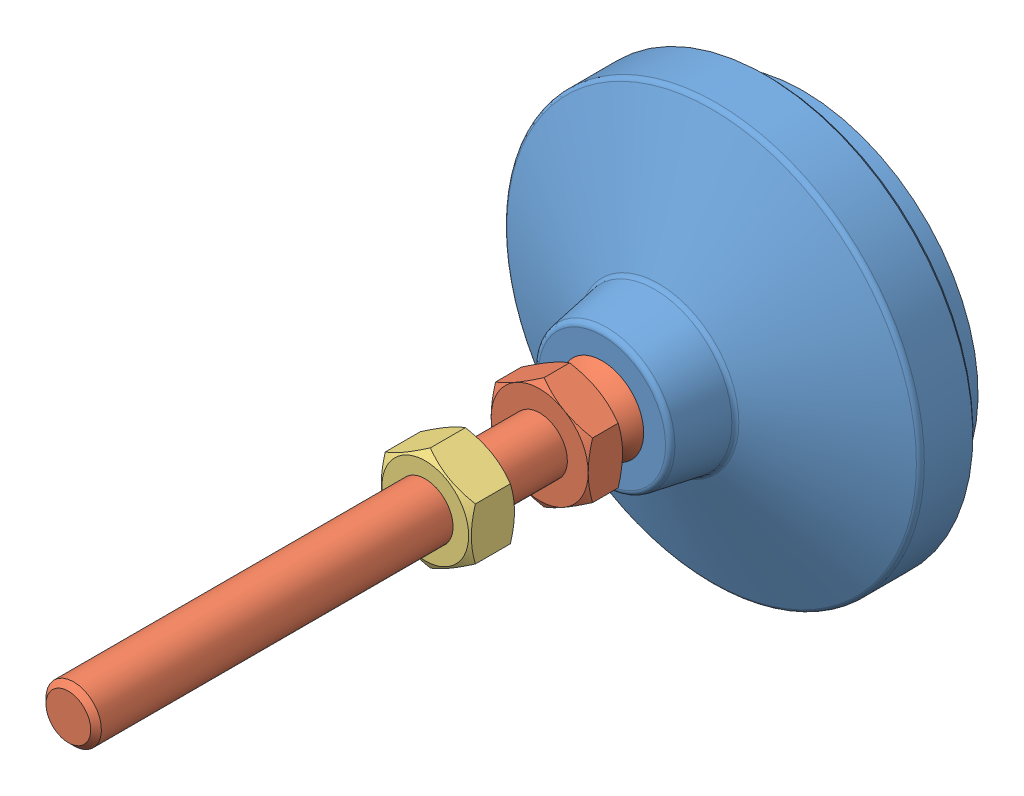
SolidWorks assembly LSVA50-M8X68-SUS.sldasm, configuration Default (file format 15000). Lengths in mm.
Overall size (60 60 106).
3 component instances, 3 part files, 0 mates.
Components (placement in the parent):
- LSVA50-M8X68-SUS_01-1: LSVA50-M8X68-SUS_01.sldprt [Default] at (0 0 5) x (1 0 0) z (0 -1 0) size (60 29 60)
- LSVA50-M8X68-SUS_02-1: LSVA50-M8X68-SUS_02.sldprt [Default] at (0 0 25.4) x (1 0 0) z (0 -1 0) size (14 87.6 16.17)
- LSVA50-M8X68-SUS_03-1: LSVA50-M8X68-SUS_03.sldprt [Default] at (0 0 48) size (13 15.01 6.5)
